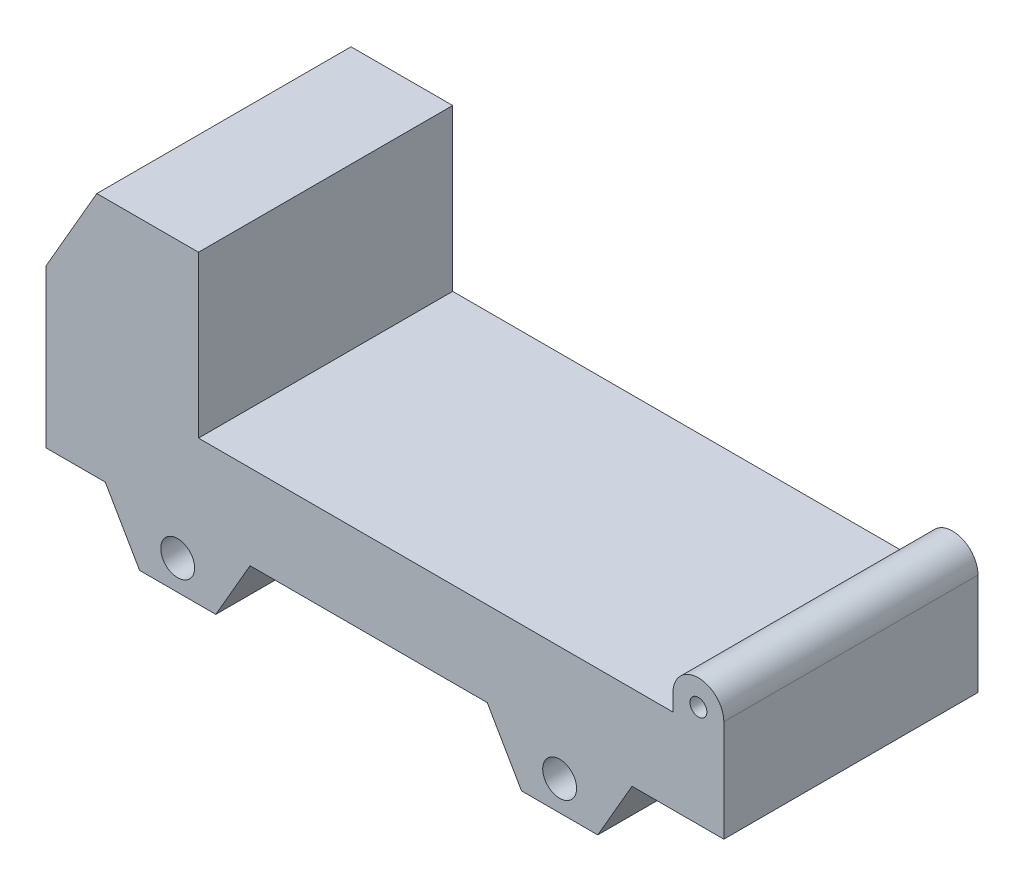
from build123d import *

# Parameters (mm, degrees)
ESQUISSE1_R        = 10
ESQUISSE1_R_2      = 5
BOSS_EXTRU_1_DEPTH = 150


with BuildPart() as part:
    # Esquisse1 → Boss.-Extru.1 (new body)
    with BuildSketch(Plane.XY):
        with BuildLine():
            Line((280, 0), (0, 0))
            Line((0, 0), (0, 95))
            Line((0, 95), (-60, 95))
            Line((-60, 95), (-90, 43.038475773))
            Line((-90, 43.038475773), (-90, -50))
            Line((-90, -50), (-55, -50))
            Line((-55, -50), (-34.792740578, -85))
            Line((-34.792740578, -85), (10.207259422, -85))
            Line((10.207259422, -85), (30.414518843, -50))
            Line((30.414518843, -50), (170.414518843, -50))
            Line((170.414518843, -50), (190.621778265, -85))
            Line((190.621778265, -85), (235.621778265, -85))
            Line((235.621778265, -85), (255.829037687, -50))
            Line((255.829037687, -50), (310, -50))
            Line((310, -50), (310, 0))
            Line((310, 0), (310, 10))
            ThreePointArc((310, 10), (295, 25), (280, 10))
            Line((280, 10), (280, 0))
        make_face()
        with Locations((-12.292740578, -67.5)):
            Circle(ESQUISSE1_R, mode=Mode.SUBTRACT)
        with Locations((213.121778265, -67.5)):
            Circle(ESQUISSE1_R, mode=Mode.SUBTRACT)
        with Locations((295, 10)):
            Circle(ESQUISSE1_R_2, mode=Mode.SUBTRACT)
    extrude(amount=BOSS_EXTRU_1_DEPTH)


solid = part.part
